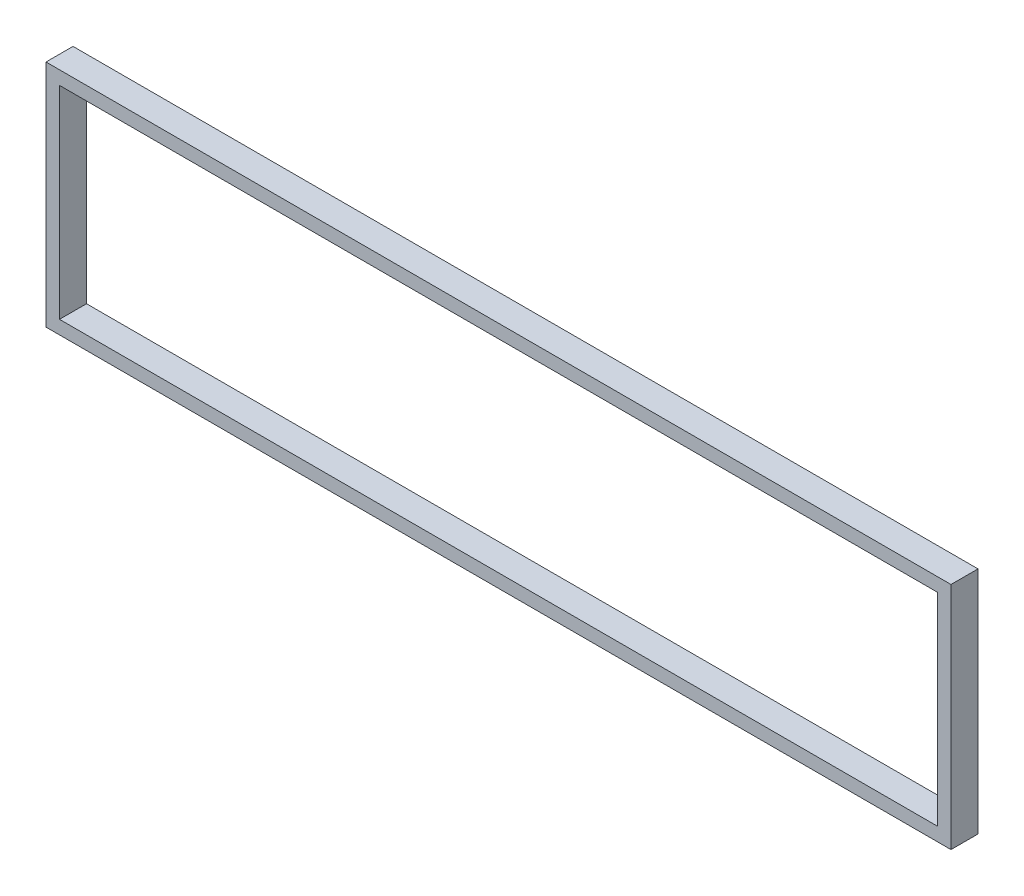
from build123d import *

# Parameters (mm, degrees)
SKETCH1_W          = 670
SKETCH1_H          = 170
SKETCH1_W_2        = 650
SKETCH1_H_2        = 150
BASE_EXTRUDE_DEPTH = 10


with BuildPart() as part:
    # Sketch1 → Base-Extrude (new, symmetric)
    with BuildSketch(Plane.XY):
        with Locations((-54175, 75)):
            Rectangle(SKETCH1_W, SKETCH1_H)
        with Locations((-54175, 75)):
            Rectangle(SKETCH1_W_2, SKETCH1_H_2, mode=Mode.SUBTRACT)
    extrude(amount=BASE_EXTRUDE_DEPTH, both=True)


solid = part.part
